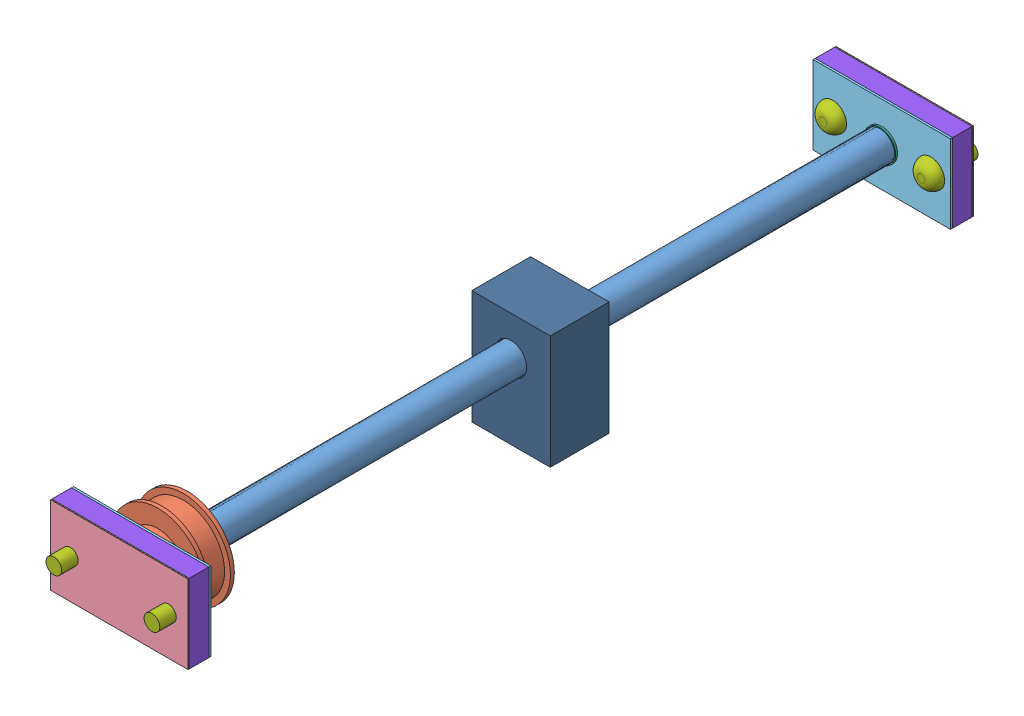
SolidWorks assembly Y-Husillo con apollos y tureca.SLDASM, configuration Predeterminado (file format 3800). Lengths in mm.
Overall size (70 62 417).
26 component instances, 10 part files, 0 mates.
Components (placement in the parent):
- Y-Husillo con apollos-1: Y-Husillo con apollos.SLDASM [Predeterminado] at origin size (70 48 417)
  - Y-Husillo-1: Y-Husillo.SLDPRT [Predeterminado] at origin size (15 15 397)
  - Y-Polea (26 XL 037)-1: Y-Polea (26 XL 037).SLDPRT [Predeterminado] at (0 0 353) x (1 0 0) z (0 -1 0) size (48 22 48)
  - Y-Rodamiento completo-1: Y-Rodamiento completo.SLDASM [Predeterminado] at (0 0 -2) size (70 40 25)
    - Y-Apollo Soporte-1: Y-Apollo Soporte.SLDPRT [Predeterminado] at (0 0 -10) x (-1 0 0) z (0 0 -1) size (70 40 0.5)
    - Y-Protector completo fino-1: Y-Protector completo fino.SLDPRT [Predeterminado] at (0 0 -10.5) x (-1 0 0) z (0 0 -1) size (70 40 0.1)
    - Y-Protector con agujero-1: Y-Protector con agujero.SLDPRT [Predeterminado] at (0 0 1) x (-1 0 0) z (0 0 -1) size (70 40 1)
    - Y-Funda ()-1: Y-Funda ().SLDPRT [Predeterminado] at (0 0 2) x (-1 0 0) z (0 0 -1) size (16 16 10)
    - Y-Rodamiento con soporte y tornillo-1: Y-Rodamiento con soporte y tornillo.SLDASM [Predeterminado] at (0 0 0.5) size (70 40 25)
      - Y-Tornillo M8 x20-2: Y-Tornillo M8 x20.SLDPRT [Predeterminado] at (-25 0 5.5) x (-1 0 0) z (0 0 -1) size (14 14 25)
      - Y-Tornillo M8 x20-1: Y-Tornillo M8 x20.SLDPRT [Predeterminado] at (25 0 5.5) x (-1 0 0) z (0 0 -1) size (14 14 25)
      - Y-Rodamiento con soporte-1: Y-Rodamiento con soporte.SLDASM [Predeterminado] at (0 0 -10.5) size (70 40 10)
        - Y-Soporte rodamiento-1: Y-Soporte rodamiento.SLDPRT [Predeterminado] at origin size (70 40 10)
        - Y-Rodamiento (7201.2RS.TVP)-1: Y-Rodamiento (7201.2RS.TVP).SLDPRT [Predeterminado] at origin size (32 32 10)
  - Y-Rodamiento completo-2: Y-Rodamiento completo.SLDASM [Predeterminado] at (0 0 377) x (-1 0 0) z (0 0 -1) size (70 40 25)
    - Y-Apollo Soporte-1: Y-Apollo Soporte.SLDPRT [Predeterminado] at (0 0 -10) x (-1 0 0) z (0 0 -1) size (70 40 0.5)
    - Y-Protector completo fino-1: Y-Protector completo fino.SLDPRT [Predeterminado] at (0 0 -10.5) x (-1 0 0) z (0 0 -1) size (70 40 0.1)
    - Y-Protector con agujero-1: Y-Protector con agujero.SLDPRT [Predeterminado] at (0 0 1) x (-1 0 0) z (0 0 -1) size (70 40 1)
    - Y-Funda ()-1: Y-Funda ().SLDPRT [Predeterminado] at (0 0 2) x (-1 0 0) z (0 0 -1) size (16 16 10)
    - Y-Rodamiento con soporte y tornillo-1: Y-Rodamiento con soporte y tornillo.SLDASM [Predeterminado] at (0 0 0.5) size (70 40 25)
      - Y-Tornillo M8 x20-2: Y-Tornillo M8 x20.SLDPRT [Predeterminado] at (-25 0 5.5) x (-1 0 0) z (0 0 -1) size (14 14 25)
      - Y-Tornillo M8 x20-1: Y-Tornillo M8 x20.SLDPRT [Predeterminado] at (25 0 5.5) x (-1 0 0) z (0 0 -1) size (14 14 25)
      - Y-Rodamiento con soporte-1: Y-Rodamiento con soporte.SLDASM [Predeterminado] at (0 0 -10.5) size (70 40 10)
        - Y-Soporte rodamiento-1: Y-Soporte rodamiento.SLDPRT [Predeterminado] at origin size (70 40 10)
        - Y-Rodamiento (7201.2RS.TVP)-1: Y-Rodamiento (7201.2RS.TVP).SLDPRT [Predeterminado] at origin size (32 32 10)
- Y-Turerca nylon-1: Y-Turerca nylon.SLDPRT [Predeterminado] at (0 20 173) x (1 0 0) z (0 -1 0) size (40 30 58)
